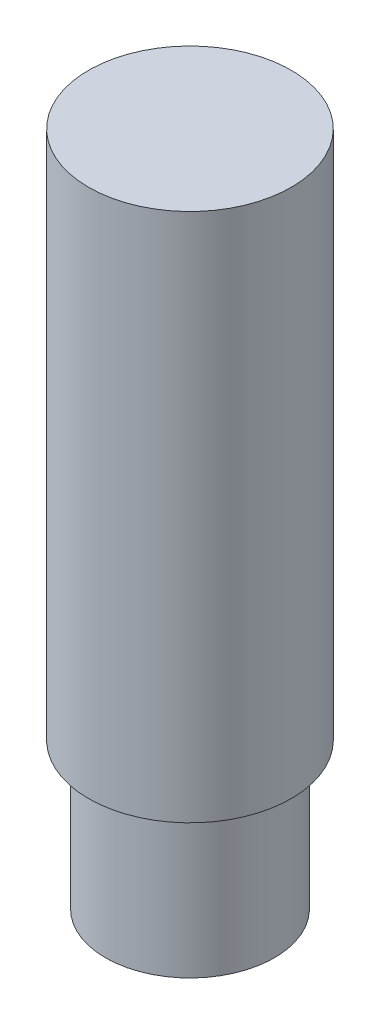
from build123d import *

# Parameters (mm, degrees)
SKETCH1_R      = 1.905
EXTRUDE1_DEPTH = 7.62
SKETCH2_R      = 2.286
EXTRUDE2_DEPTH = 11.94


with BuildPart() as part:
    # Sketch1 → Extrude1 (new, symmetric)
    with BuildSketch(Plane(origin=(0, 0, 0), x_dir=(1, 0, 0), z_dir=(0, 1, 0))):
        with Locations(Location((0, 0, 0), (0, 0, 90))):
            Circle(SKETCH1_R)
    extrude(amount=EXTRUDE1_DEPTH, both=True)

    # Sketch2 → Extrude2 (add)
    with BuildSketch(Plane(origin=(0, 7.62, 0), x_dir=(-1, 0, 0), z_dir=(0, 1, 0))):
        with Locations(Location((0, 0, 0), (0, 0, 90))):
            Circle(SKETCH2_R)
    extrude(amount=-EXTRUDE2_DEPTH)


solid = part.part
